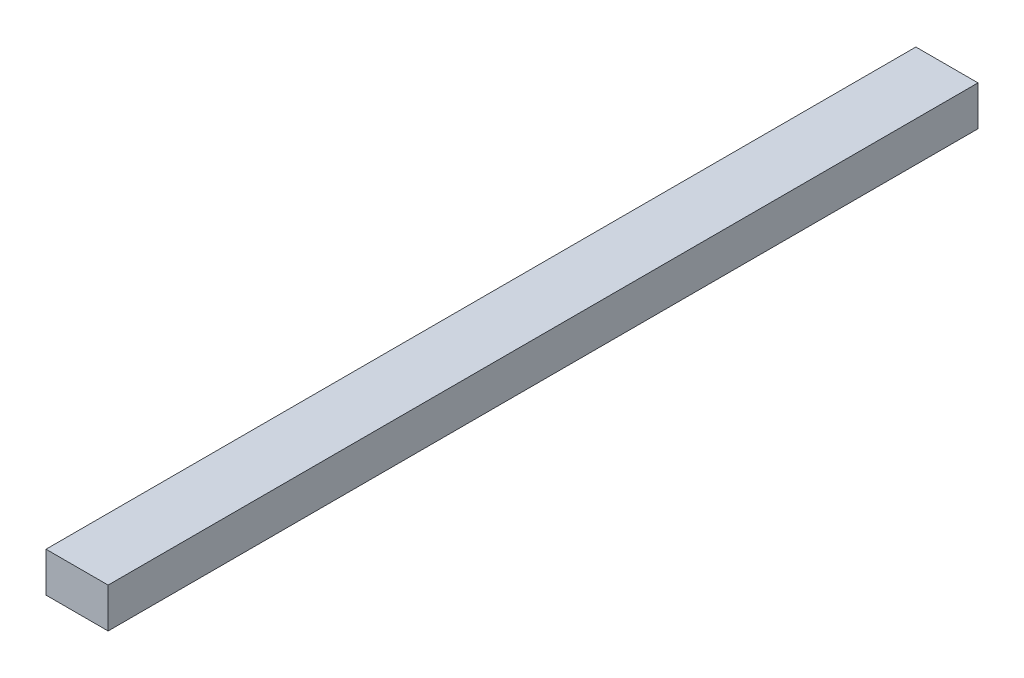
from build123d import *

# Parameters (mm, degrees)
CROQUIS1_W           = 55
CROQUIS1_H           = 35
EXTRUIR1_DEPTH       = 350
CEPILLADO_DEPTH      = 352.514580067
CEPILLADO_DEPTH_BACK = 352.514580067
CROQUIS2_W           = 55
CROQUIS2_H           = 35
CROQUIS2_W_2         = 50
CROQUIS2_H_2         = 32


with BuildPart() as part:
    # Croquis1 → Extruir1 (new, symmetric)
    with BuildSketch(Plane.XY):
        Rectangle(CROQUIS1_W, CROQUIS1_H)
    extrude(amount=EXTRUIR1_DEPTH, both=True)

    # Croquis2 → Cepillado (cut, two sides: drawn at the far end of the back side and taken through both)
    with BuildSketch(Plane.XY.offset(-CEPILLADO_DEPTH_BACK)):
        Rectangle(CROQUIS2_W, CROQUIS2_H)
        Rectangle(CROQUIS2_W_2, CROQUIS2_H_2, mode=Mode.SUBTRACT)
    extrude(amount=CEPILLADO_DEPTH + CEPILLADO_DEPTH_BACK, mode=Mode.SUBTRACT)


solid = part.part
